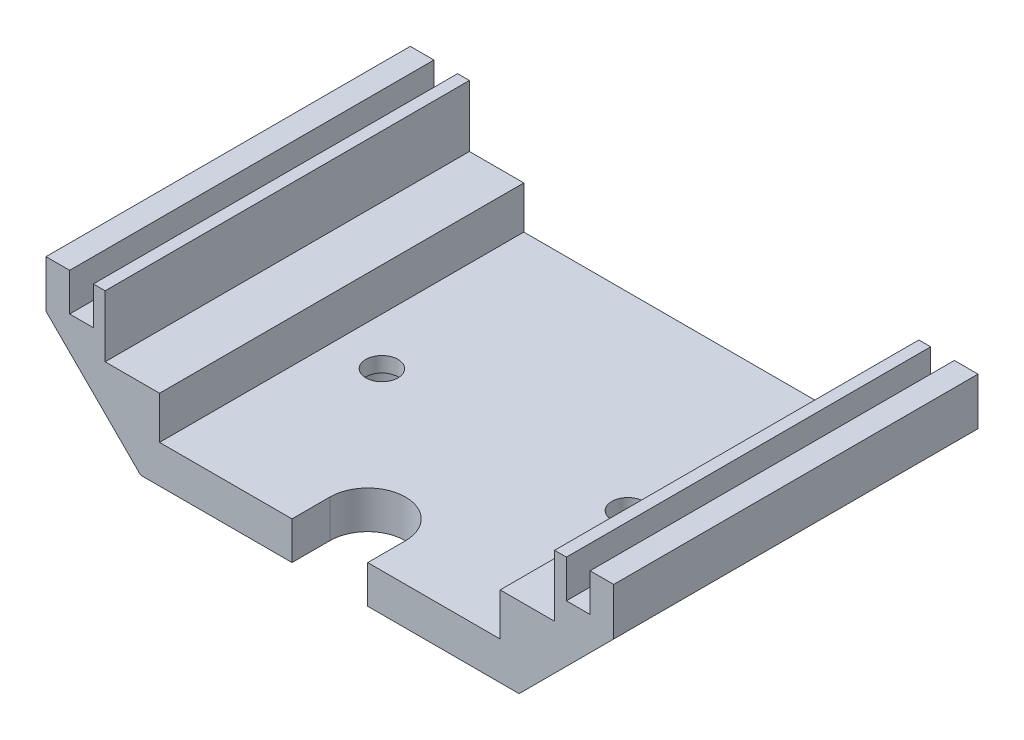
ISO-10303-21;
HEADER;
FILE_DESCRIPTION(('STEP AP214'),'2;1');
FILE_NAME('part.step','',(''),(''),'','','');
FILE_SCHEMA(('AUTOMOTIVE_DESIGN { 1 0 10303 214 1 1 1 1 }'));
ENDSEC;
DATA;
#1=APPLICATION_CONTEXT('core data for automotive mechanical design processes');
#2=APPLICATION_PROTOCOL_DEFINITION('international standard','automotive_design',2000,#1);
#3=PRODUCT_CONTEXT('',#1,'mechanical');
#4=PRODUCT('Part','Part','',(#3));
#5=PRODUCT_RELATED_PRODUCT_CATEGORY('part','',(#4));
#6=PRODUCT_DEFINITION_FORMATION('','',#4);
#7=PRODUCT_DEFINITION_CONTEXT('part definition',#1,'design');
#8=PRODUCT_DEFINITION('design','',#6,#7);
#9=PRODUCT_DEFINITION_SHAPE('','',#8);
#10=(LENGTH_UNIT() NAMED_UNIT(*) SI_UNIT(.MILLI.,.METRE.));
#11=(NAMED_UNIT(*) PLANE_ANGLE_UNIT() SI_UNIT($,.RADIAN.));
#12=(NAMED_UNIT(*) SI_UNIT($,.STERADIAN.) SOLID_ANGLE_UNIT());
#13=UNCERTAINTY_MEASURE_WITH_UNIT(LENGTH_MEASURE(1.E-05),#10,'distance_accuracy_value','');
#14=(GEOMETRIC_REPRESENTATION_CONTEXT(3) GLOBAL_UNCERTAINTY_ASSIGNED_CONTEXT((#13)) GLOBAL_UNIT_ASSIGNED_CONTEXT((#10,
#11,#12)) REPRESENTATION_CONTEXT('',''));
#15=CARTESIAN_POINT('',(0.,0.,0.));
#16=DIRECTION('',(0.,0.,1.));
#17=DIRECTION('',(1.,0.,0.));
#18=AXIS2_PLACEMENT_3D('',#15,#16,#17);
#19=CARTESIAN_POINT('',(-23.7500000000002,11.,3.33066907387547E-13));
#20=DIRECTION('',(0.,1.,0.));
#21=DIRECTION('',(0.,0.,1.));
#22=AXIS2_PLACEMENT_3D('',#19,#20,#21);
#23=PLANE('',#22);
#24=DIRECTION('',(0.,0.,1.));
#25=VECTOR('',#24,1.);
#26=CARTESIAN_POINT('',(-25.,11.,0.));
#27=LINE('',#26,#25);
#28=CARTESIAN_POINT('',(-25.,11.,38.5));
#29=VERTEX_POINT('',#28);
#30=CARTESIAN_POINT('',(-25.,11.,1.11022302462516E-13));
#31=VERTEX_POINT('',#30);
#32=EDGE_CURVE('E285',#29,#31,#27,.F.);
#33=ORIENTED_EDGE('',*,*,#32,.F.);
#34=DIRECTION('',(1.,0.,0.));
#35=VECTOR('',#34,1.);
#36=CARTESIAN_POINT('',(-23.7500000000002,11.,38.5));
#37=LINE('',#36,#35);
#38=CARTESIAN_POINT('',(-23.75,11.,38.5));
#39=VERTEX_POINT('',#38);
#40=EDGE_CURVE('E350',#29,#39,#37,.T.);
#41=ORIENTED_EDGE('',*,*,#40,.T.);
#42=DIRECTION('',(0.,0.,1.));
#43=VECTOR('',#42,1.);
#44=CARTESIAN_POINT('',(-23.7500000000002,11.,3.33066907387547E-13));
#45=LINE('',#44,#43);
#46=CARTESIAN_POINT('',(-23.7500000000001,11.,2.91433543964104E-13));
#47=VERTEX_POINT('',#46);
#48=EDGE_CURVE('E294',#47,#39,#45,.T.);
#49=ORIENTED_EDGE('',*,*,#48,.F.);
#50=DIRECTION('',(1.,0.,0.));
#51=VECTOR('',#50,1.);
#52=CARTESIAN_POINT('',(-23.7500000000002,11.,3.33066907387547E-13));
#53=LINE('',#52,#51);
#54=EDGE_CURVE('E357',#47,#31,#53,.F.);
#55=ORIENTED_EDGE('',*,*,#54,.T.);
#56=EDGE_LOOP('',(#33,#41,#49,#55));
#57=FACE_BOUND('',#56,.T.);
#58=ADVANCED_FACE('F16',(#57),#23,.T.);
#59=CARTESIAN_POINT('',(25.,11.,2.22044604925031E-13));
#60=DIRECTION('',(0.,1.,0.));
#61=DIRECTION('',(0.,0.,1.));
#62=AXIS2_PLACEMENT_3D('',#59,#60,#61);
#63=PLANE('',#62);
#64=DIRECTION('',(0.,0.,1.));
#65=VECTOR('',#64,1.);
#66=CARTESIAN_POINT('',(23.75,11.,3.33066907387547E-13));
#67=LINE('',#66,#65);
#68=CARTESIAN_POINT('',(23.75,11.,38.5));
#69=VERTEX_POINT('',#68);
#70=CARTESIAN_POINT('',(23.75,11.,1.94289029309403E-13));
#71=VERTEX_POINT('',#70);
#72=EDGE_CURVE('E192',#69,#71,#67,.F.);
#73=ORIENTED_EDGE('',*,*,#72,.F.);
#74=DIRECTION('',(1.,0.,0.));
#75=VECTOR('',#74,1.);
#76=CARTESIAN_POINT('',(25.,11.,38.5));
#77=LINE('',#76,#75);
#78=CARTESIAN_POINT('',(25.,11.,38.5000000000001));
#79=VERTEX_POINT('',#78);
#80=EDGE_CURVE('E344',#69,#79,#77,.T.);
#81=ORIENTED_EDGE('',*,*,#80,.T.);
#82=DIRECTION('',(0.,0.,1.));
#83=VECTOR('',#82,1.);
#84=CARTESIAN_POINT('',(25.,11.,2.22044604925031E-13));
#85=LINE('',#84,#83);
#86=CARTESIAN_POINT('',(25.,11.,1.66533453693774E-13));
#87=VERTEX_POINT('',#86);
#88=EDGE_CURVE('E195',#87,#79,#85,.T.);
#89=ORIENTED_EDGE('',*,*,#88,.F.);
#90=DIRECTION('',(1.,0.,0.));
#91=VECTOR('',#90,1.);
#92=CARTESIAN_POINT('',(25.,11.,2.22044604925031E-13));
#93=LINE('',#92,#91);
#94=EDGE_CURVE('E347',#87,#71,#93,.F.);
#95=ORIENTED_EDGE('',*,*,#94,.T.);
#96=EDGE_LOOP('',(#73,#81,#89,#95));
#97=FACE_BOUND('',#96,.T.);
#98=ADVANCED_FACE('F691',(#97),#63,.T.);
#99=CARTESIAN_POINT('',(-13.,-4.00000000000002,20.));
#100=DIRECTION('',(0.,1.,0.));
#101=DIRECTION('',(0.,0.,1.));
#102=AXIS2_PLACEMENT_3D('',#99,#100,#101);
#103=CYLINDRICAL_SURFACE('',#102,1.7);
#104=CARTESIAN_POINT('',(-13.,-1.6,20.));
#105=DIRECTION('',(0.,1.,0.));
#106=DIRECTION('',(0.,0.,1.));
#107=AXIS2_PLACEMENT_3D('',#104,#105,#106);
#108=CIRCLE('',#107,1.7);
#109=CARTESIAN_POINT('',(-13.,-1.6,21.7));
#110=VERTEX_POINT('',#109);
#111=EDGE_CURVE('E303',#110,#110,#108,.F.);
#112=ORIENTED_EDGE('',*,*,#111,.T.);
#113=EDGE_LOOP('',(#112));
#114=FACE_BOUND('',#113,.T.);
#115=CARTESIAN_POINT('',(-13.,0.,20.));
#116=DIRECTION('',(0.,1.,0.));
#117=DIRECTION('',(0.,0.,1.));
#118=AXIS2_PLACEMENT_3D('',#115,#116,#117);
#119=CIRCLE('',#118,1.7);
#120=CARTESIAN_POINT('',(-13.,0.,21.7));
#121=VERTEX_POINT('',#120);
#122=EDGE_CURVE('E188',#121,#121,#119,.F.);
#123=ORIENTED_EDGE('',*,*,#122,.F.);
#124=EDGE_LOOP('',(#123));
#125=FACE_BOUND('',#124,.T.);
#126=ADVANCED_FACE('F414',(#114,#125),#103,.F.);
#127=CARTESIAN_POINT('',(13.,-4.00000000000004,20.));
#128=DIRECTION('',(0.,1.,0.));
#129=DIRECTION('',(0.,0.,1.));
#130=AXIS2_PLACEMENT_3D('',#127,#128,#129);
#131=CYLINDRICAL_SURFACE('',#130,1.7);
#132=CARTESIAN_POINT('',(13.,-1.60000000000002,20.));
#133=DIRECTION('',(0.,1.,0.));
#134=DIRECTION('',(0.,0.,1.));
#135=AXIS2_PLACEMENT_3D('',#132,#133,#134);
#136=CIRCLE('',#135,1.7);
#137=CARTESIAN_POINT('',(13.,-1.60000000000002,21.7));
#138=VERTEX_POINT('',#137);
#139=EDGE_CURVE('E19',#138,#138,#136,.F.);
#140=ORIENTED_EDGE('',*,*,#139,.T.);
#141=EDGE_LOOP('',(#140));
#142=FACE_BOUND('',#141,.T.);
#143=CARTESIAN_POINT('',(13.,0.,20.));
#144=DIRECTION('',(0.,1.,0.));
#145=DIRECTION('',(0.,0.,1.));
#146=AXIS2_PLACEMENT_3D('',#143,#144,#145);
#147=CIRCLE('',#146,1.7);
#148=CARTESIAN_POINT('',(13.,0.,21.7));
#149=VERTEX_POINT('',#148);
#150=EDGE_CURVE('E220',#149,#149,#147,.F.);
#151=ORIENTED_EDGE('',*,*,#150,.F.);
#152=EDGE_LOOP('',(#151));
#153=FACE_BOUND('',#152,.T.);
#154=ADVANCED_FACE('F398',(#142,#153),#131,.F.);
#155=CARTESIAN_POINT('',(13.,-1.60000000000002,20.));
#156=DIRECTION('',(0.,1.,0.));
#157=DIRECTION('',(0.,0.,1.));
#158=AXIS2_PLACEMENT_3D('',#155,#156,#157);
#159=PLANE('',#158);
#160=CARTESIAN_POINT('',(13.,-1.60000000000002,20.));
#161=DIRECTION('',(0.,1.,0.));
#162=DIRECTION('',(0.,0.,1.));
#163=AXIS2_PLACEMENT_3D('',#160,#161,#162);
#164=CIRCLE('',#163,3.);
#165=CARTESIAN_POINT('',(13.,-1.60000000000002,23.));
#166=VERTEX_POINT('',#165);
#167=EDGE_CURVE('E183',#166,#166,#164,.F.);
#168=ORIENTED_EDGE('',*,*,#167,.T.);
#169=EDGE_LOOP('',(#168));
#170=FACE_BOUND('',#169,.T.);
#171=ORIENTED_EDGE('',*,*,#139,.F.);
#172=EDGE_LOOP('',(#171));
#173=FACE_BOUND('',#172,.T.);
#174=ADVANCED_FACE('F401',(#170,#173),#159,.F.);
#175=CARTESIAN_POINT('',(-13.,-1.6,20.));
#176=DIRECTION('',(0.,1.,0.));
#177=DIRECTION('',(0.,0.,1.));
#178=AXIS2_PLACEMENT_3D('',#175,#176,#177);
#179=PLANE('',#178);
#180=CARTESIAN_POINT('',(-13.,-1.6,20.));
#181=DIRECTION('',(0.,1.,0.));
#182=DIRECTION('',(0.,0.,1.));
#183=AXIS2_PLACEMENT_3D('',#180,#181,#182);
#184=CIRCLE('',#183,3.);
#185=CARTESIAN_POINT('',(-13.,-1.6,23.));
#186=VERTEX_POINT('',#185);
#187=EDGE_CURVE('E159',#186,#186,#184,.F.);
#188=ORIENTED_EDGE('',*,*,#187,.T.);
#189=EDGE_LOOP('',(#188));
#190=FACE_BOUND('',#189,.T.);
#191=ORIENTED_EDGE('',*,*,#111,.F.);
#192=EDGE_LOOP('',(#191));
#193=FACE_BOUND('',#192,.T.);
#194=ADVANCED_FACE('F403',(#190,#193),#179,.F.);
#195=CARTESIAN_POINT('',(-18.0000000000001,0.,3.33066907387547E-13));
#196=DIRECTION('',(1.,0.,0.));
#197=DIRECTION('',(0.,1.,0.));
#198=AXIS2_PLACEMENT_3D('',#195,#196,#197);
#199=PLANE('',#198);
#200=DIRECTION('',(0.,0.,1.));
#201=VECTOR('',#200,1.);
#202=CARTESIAN_POINT('',(-18.0000000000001,4.5,3.33066907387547E-13));
#203=LINE('',#202,#201);
#204=CARTESIAN_POINT('',(-18.0000000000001,4.5,38.5000000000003));
#205=VERTEX_POINT('',#204);
#206=CARTESIAN_POINT('',(-18.0000000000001,4.5,2.4980018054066E-13));
#207=VERTEX_POINT('',#206);
#208=EDGE_CURVE('E300',#205,#207,#203,.F.);
#209=ORIENTED_EDGE('',*,*,#208,.F.);
#210=DIRECTION('',(0.,-1.,0.));
#211=VECTOR('',#210,1.);
#212=CARTESIAN_POINT('',(-18.0000000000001,0.,38.5000000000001));
#213=LINE('',#212,#211);
#214=CARTESIAN_POINT('',(-18.0000000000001,0.,38.5000000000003));
#215=VERTEX_POINT('',#214);
#216=EDGE_CURVE('E332',#215,#205,#213,.F.);
#217=ORIENTED_EDGE('',*,*,#216,.F.);
#218=DIRECTION('',(0.,0.,1.));
#219=VECTOR('',#218,1.);
#220=CARTESIAN_POINT('',(-18.0000000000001,0.,0.));
#221=LINE('',#220,#219);
#222=CARTESIAN_POINT('',(-18.0000000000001,0.,0.));
#223=VERTEX_POINT('',#222);
#224=EDGE_CURVE('E181',#223,#215,#221,.T.);
#225=ORIENTED_EDGE('',*,*,#224,.F.);
#226=DIRECTION('',(0.,-1.,0.));
#227=VECTOR('',#226,1.);
#228=CARTESIAN_POINT('',(-18.0000000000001,0.,0.));
#229=LINE('',#228,#227);
#230=EDGE_CURVE('E341',#223,#207,#229,.F.);
#231=ORIENTED_EDGE('',*,*,#230,.T.);
#232=EDGE_LOOP('',(#209,#217,#225,#231));
#233=FACE_BOUND('',#232,.T.);
#234=ADVANCED_FACE('F411',(#233),#199,.T.);
#235=CARTESIAN_POINT('',(-18.0000000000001,4.5,3.33066907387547E-13));
#236=DIRECTION('',(0.,1.,0.));
#237=DIRECTION('',(0.,0.,1.));
#238=AXIS2_PLACEMENT_3D('',#235,#236,#237);
#239=PLANE('',#238);
#240=DIRECTION('',(0.,0.,1.));
#241=VECTOR('',#240,1.);
#242=CARTESIAN_POINT('',(-23.7500000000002,4.5,3.33066907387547E-13));
#243=LINE('',#242,#241);
#244=CARTESIAN_POINT('',(-23.7500000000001,4.5,38.5000000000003));
#245=VERTEX_POINT('',#244);
#246=CARTESIAN_POINT('',(-23.7500000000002,4.5,2.4980018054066E-13));
#247=VERTEX_POINT('',#246);
#248=EDGE_CURVE('E297',#245,#247,#243,.F.);
#249=ORIENTED_EDGE('',*,*,#248,.F.);
#250=DIRECTION('',(1.,0.,0.));
#251=VECTOR('',#250,1.);
#252=CARTESIAN_POINT('',(0.,4.5,38.5000000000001));
#253=LINE('',#252,#251);
#254=EDGE_CURVE('E369',#205,#245,#253,.F.);
#255=ORIENTED_EDGE('',*,*,#254,.F.);
#256=ORIENTED_EDGE('',*,*,#208,.T.);
#257=DIRECTION('',(1.,0.,0.));
#258=VECTOR('',#257,1.);
#259=CARTESIAN_POINT('',(0.,4.5,0.));
#260=LINE('',#259,#258);
#261=EDGE_CURVE('E374',#207,#247,#260,.F.);
#262=ORIENTED_EDGE('',*,*,#261,.T.);
#263=EDGE_LOOP('',(#249,#255,#256,#262));
#264=FACE_BOUND('',#263,.T.);
#265=ADVANCED_FACE('F517',(#264),#239,.T.);
#266=CARTESIAN_POINT('',(-23.7500000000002,4.5,3.33066907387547E-13));
#267=DIRECTION('',(1.,0.,0.));
#268=DIRECTION('',(0.,1.,0.));
#269=AXIS2_PLACEMENT_3D('',#266,#267,#268);
#270=PLANE('',#269);
#271=ORIENTED_EDGE('',*,*,#48,.T.);
#272=DIRECTION('',(0.,-1.,0.));
#273=VECTOR('',#272,1.);
#274=CARTESIAN_POINT('',(-23.75,0.,38.5000000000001));
#275=LINE('',#274,#273);
#276=EDGE_CURVE('E326',#245,#39,#275,.F.);
#277=ORIENTED_EDGE('',*,*,#276,.F.);
#278=ORIENTED_EDGE('',*,*,#248,.T.);
#279=DIRECTION('',(0.,-1.,0.));
#280=VECTOR('',#279,1.);
#281=CARTESIAN_POINT('',(-23.7500000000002,0.,0.));
#282=LINE('',#281,#280);
#283=EDGE_CURVE('E289',#247,#47,#282,.F.);
#284=ORIENTED_EDGE('',*,*,#283,.T.);
#285=EDGE_LOOP('',(#271,#277,#278,#284));
#286=FACE_BOUND('',#285,.T.);
#287=ADVANCED_FACE('F513',(#286),#270,.T.);
#288=CARTESIAN_POINT('',(-25.,11.,0.));
#289=DIRECTION('',(-1.,0.,0.));
#290=DIRECTION('',(0.,-1.,0.));
#291=AXIS2_PLACEMENT_3D('',#288,#289,#290);
#292=PLANE('',#291);
#293=DIRECTION('',(0.,0.,1.));
#294=VECTOR('',#293,1.);
#295=CARTESIAN_POINT('',(-25.,7.,0.));
#296=LINE('',#295,#294);
#297=CARTESIAN_POINT('',(-25.,7.,38.5000000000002));
#298=VERTEX_POINT('',#297);
#299=CARTESIAN_POINT('',(-25.,7.,0.));
#300=VERTEX_POINT('',#299);
#301=EDGE_CURVE('E276',#298,#300,#296,.F.);
#302=ORIENTED_EDGE('',*,*,#301,.F.);
#303=DIRECTION('',(0.,-1.,0.));
#304=VECTOR('',#303,1.);
#305=CARTESIAN_POINT('',(-25.,0.,38.5000000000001));
#306=LINE('',#305,#304);
#307=EDGE_CURVE('E321',#29,#298,#306,.T.);
#308=ORIENTED_EDGE('',*,*,#307,.F.);
#309=ORIENTED_EDGE('',*,*,#32,.T.);
#310=DIRECTION('',(0.,-1.,0.));
#311=VECTOR('',#310,1.);
#312=CARTESIAN_POINT('',(-25.,0.,0.));
#313=LINE('',#312,#311);
#314=EDGE_CURVE('E280',#31,#300,#313,.T.);
#315=ORIENTED_EDGE('',*,*,#314,.T.);
#316=EDGE_LOOP('',(#302,#308,#309,#315));
#317=FACE_BOUND('',#316,.T.);
#318=ADVANCED_FACE('F509',(#317),#292,.T.);
#319=CARTESIAN_POINT('',(-25.,7.,0.));
#320=DIRECTION('',(0.,1.,0.));
#321=DIRECTION('',(0.,0.,1.));
#322=AXIS2_PLACEMENT_3D('',#319,#320,#321);
#323=PLANE('',#322);
#324=DIRECTION('',(0.,0.,1.));
#325=VECTOR('',#324,1.);
#326=CARTESIAN_POINT('',(-27.5000000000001,7.00000000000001,3.33066907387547E-13));
#327=LINE('',#326,#325);
#328=CARTESIAN_POINT('',(-27.5000000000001,7.,38.5000000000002));
#329=VERTEX_POINT('',#328);
#330=CARTESIAN_POINT('',(-27.5000000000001,7.,0.));
#331=VERTEX_POINT('',#330);
#332=EDGE_CURVE('E267',#329,#331,#327,.F.);
#333=ORIENTED_EDGE('',*,*,#332,.F.);
#334=DIRECTION('',(1.,0.,0.));
#335=VECTOR('',#334,1.);
#336=CARTESIAN_POINT('',(0.,7.00000000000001,38.5000000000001));
#337=LINE('',#336,#335);
#338=EDGE_CURVE('E316',#298,#329,#337,.F.);
#339=ORIENTED_EDGE('',*,*,#338,.F.);
#340=ORIENTED_EDGE('',*,*,#301,.T.);
#341=DIRECTION('',(1.,0.,0.));
#342=VECTOR('',#341,1.);
#343=CARTESIAN_POINT('',(0.,7.,0.));
#344=LINE('',#343,#342);
#345=EDGE_CURVE('E271',#300,#331,#344,.F.);
#346=ORIENTED_EDGE('',*,*,#345,.T.);
#347=EDGE_LOOP('',(#333,#339,#340,#346));
#348=FACE_BOUND('',#347,.T.);
#349=ADVANCED_FACE('F505',(#348),#323,.T.);
#350=CARTESIAN_POINT('',(-27.5000000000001,7.,3.33066907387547E-13));
#351=DIRECTION('',(1.,0.,0.));
#352=DIRECTION('',(0.,1.,0.));
#353=AXIS2_PLACEMENT_3D('',#350,#351,#352);
#354=PLANE('',#353);
#355=DIRECTION('',(0.,0.,1.));
#356=VECTOR('',#355,1.);
#357=CARTESIAN_POINT('',(-27.5000000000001,11.,3.33066907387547E-13));
#358=LINE('',#357,#356);
#359=CARTESIAN_POINT('',(-27.5000000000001,11.,38.5000000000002));
#360=VERTEX_POINT('',#359);
#361=CARTESIAN_POINT('',(-27.5000000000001,11.,0.));
#362=VERTEX_POINT('',#361);
#363=EDGE_CURVE('E258',#360,#362,#358,.F.);
#364=ORIENTED_EDGE('',*,*,#363,.F.);
#365=DIRECTION('',(0.,-1.,0.));
#366=VECTOR('',#365,1.);
#367=CARTESIAN_POINT('',(-27.5000000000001,0.,38.5000000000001));
#368=LINE('',#367,#366);
#369=EDGE_CURVE('E311',#329,#360,#368,.F.);
#370=ORIENTED_EDGE('',*,*,#369,.F.);
#371=ORIENTED_EDGE('',*,*,#332,.T.);
#372=DIRECTION('',(0.,-1.,0.));
#373=VECTOR('',#372,1.);
#374=CARTESIAN_POINT('',(-27.5000000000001,0.,0.));
#375=LINE('',#374,#373);
#376=EDGE_CURVE('E262',#331,#362,#375,.F.);
#377=ORIENTED_EDGE('',*,*,#376,.T.);
#378=EDGE_LOOP('',(#364,#370,#371,#377));
#379=FACE_BOUND('',#378,.T.);
#380=ADVANCED_FACE('F501',(#379),#354,.T.);
#381=CARTESIAN_POINT('',(-27.5000000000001,11.,3.33066907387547E-13));
#382=DIRECTION('',(0.,1.,0.));
#383=DIRECTION('',(0.,0.,1.));
#384=AXIS2_PLACEMENT_3D('',#381,#382,#383);
#385=PLANE('',#384);
#386=DIRECTION('',(0.,0.,1.));
#387=VECTOR('',#386,1.);
#388=CARTESIAN_POINT('',(-30.0000000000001,11.,2.22044604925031E-13));
#389=LINE('',#388,#387);
#390=CARTESIAN_POINT('',(-30.0000000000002,11.,38.5000000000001));
#391=VERTEX_POINT('',#390);
#392=CARTESIAN_POINT('',(-30.0000000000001,11.,0.));
#393=VERTEX_POINT('',#392);
#394=EDGE_CURVE('E236',#391,#393,#389,.F.);
#395=ORIENTED_EDGE('',*,*,#394,.F.);
#396=DIRECTION('',(1.,0.,0.));
#397=VECTOR('',#396,1.);
#398=CARTESIAN_POINT('',(0.,11.,38.5000000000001));
#399=LINE('',#398,#397);
#400=EDGE_CURVE('E306',#360,#391,#399,.F.);
#401=ORIENTED_EDGE('',*,*,#400,.F.);
#402=ORIENTED_EDGE('',*,*,#363,.T.);
#403=DIRECTION('',(1.,0.,0.));
#404=VECTOR('',#403,1.);
#405=CARTESIAN_POINT('',(0.,11.,0.));
#406=LINE('',#405,#404);
#407=EDGE_CURVE('E253',#362,#393,#406,.F.);
#408=ORIENTED_EDGE('',*,*,#407,.T.);
#409=EDGE_LOOP('',(#395,#401,#402,#408));
#410=FACE_BOUND('',#409,.T.);
#411=ADVANCED_FACE('F497',(#410),#385,.T.);
#412=CARTESIAN_POINT('',(-30.0000000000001,11.,2.22044604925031E-13));
#413=DIRECTION('',(-1.,0.,0.));
#414=DIRECTION('',(0.,-1.,0.));
#415=AXIS2_PLACEMENT_3D('',#412,#413,#414);
#416=PLANE('',#415);
#417=DIRECTION('',(0.,0.,1.));
#418=VECTOR('',#417,1.);
#419=CARTESIAN_POINT('',(-30.0000000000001,5.99999999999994,2.22044604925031E-13));
#420=LINE('',#419,#418);
#421=CARTESIAN_POINT('',(-30.0000000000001,5.99999999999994,38.5000000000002));
#422=VERTEX_POINT('',#421);
#423=CARTESIAN_POINT('',(-30.0000000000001,5.99999999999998,0.));
#424=VERTEX_POINT('',#423);
#425=EDGE_CURVE('E244',#422,#424,#420,.F.);
#426=ORIENTED_EDGE('',*,*,#425,.F.);
#427=DIRECTION('',(0.,-1.,0.));
#428=VECTOR('',#427,1.);
#429=CARTESIAN_POINT('',(-30.0000000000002,0.,38.5000000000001));
#430=LINE('',#429,#428);
#431=EDGE_CURVE('E248',#391,#422,#430,.T.);
#432=ORIENTED_EDGE('',*,*,#431,.F.);
#433=ORIENTED_EDGE('',*,*,#394,.T.);
#434=DIRECTION('',(0.,-1.,0.));
#435=VECTOR('',#434,1.);
#436=CARTESIAN_POINT('',(-30.0000000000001,0.,0.));
#437=LINE('',#436,#435);
#438=EDGE_CURVE('E251',#393,#424,#437,.T.);
#439=ORIENTED_EDGE('',*,*,#438,.T.);
#440=EDGE_LOOP('',(#426,#432,#433,#439));
#441=FACE_BOUND('',#440,.T.);
#442=ADVANCED_FACE('F493',(#441),#416,.T.);
#443=CARTESIAN_POINT('',(30.,6.00000000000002,3.33066907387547E-13));
#444=DIRECTION('',(1.,0.,0.));
#445=DIRECTION('',(0.,1.,0.));
#446=AXIS2_PLACEMENT_3D('',#443,#444,#445);
#447=PLANE('',#446);
#448=DIRECTION('',(0.,0.,1.));
#449=VECTOR('',#448,1.);
#450=CARTESIAN_POINT('',(29.9999999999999,11.,3.33066907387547E-13));
#451=LINE('',#450,#449);
#452=CARTESIAN_POINT('',(29.9999999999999,11.,38.5000000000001));
#453=VERTEX_POINT('',#452);
#454=CARTESIAN_POINT('',(30.,11.,0.));
#455=VERTEX_POINT('',#454);
#456=EDGE_CURVE('E207',#453,#455,#451,.F.);
#457=ORIENTED_EDGE('',*,*,#456,.F.);
#458=DIRECTION('',(0.,-1.,0.));
#459=VECTOR('',#458,1.);
#460=CARTESIAN_POINT('',(29.9999999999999,0.,38.5000000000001));
#461=LINE('',#460,#459);
#462=CARTESIAN_POINT('',(29.9999999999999,6.,38.5000000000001));
#463=VERTEX_POINT('',#462);
#464=EDGE_CURVE('E212',#463,#453,#461,.F.);
#465=ORIENTED_EDGE('',*,*,#464,.F.);
#466=DIRECTION('',(0.,0.,1.));
#467=VECTOR('',#466,1.);
#468=CARTESIAN_POINT('',(30.,6.,3.33066907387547E-13));
#469=LINE('',#468,#467);
#470=CARTESIAN_POINT('',(30.,6.00000000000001,2.22044604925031E-13));
#471=VERTEX_POINT('',#470);
#472=EDGE_CURVE('E178',#471,#463,#469,.T.);
#473=ORIENTED_EDGE('',*,*,#472,.F.);
#474=DIRECTION('',(0.,-1.,0.));
#475=VECTOR('',#474,1.);
#476=CARTESIAN_POINT('',(30.,0.,0.));
#477=LINE('',#476,#475);
#478=EDGE_CURVE('E228',#471,#455,#477,.F.);
#479=ORIENTED_EDGE('',*,*,#478,.T.);
#480=EDGE_LOOP('',(#457,#465,#473,#479));
#481=FACE_BOUND('',#480,.T.);
#482=ADVANCED_FACE('F489',(#481),#447,.T.);
#483=CARTESIAN_POINT('',(30.,11.,3.33066907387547E-13));
#484=DIRECTION('',(0.,1.,0.));
#485=DIRECTION('',(0.,0.,1.));
#486=AXIS2_PLACEMENT_3D('',#483,#484,#485);
#487=PLANE('',#486);
#488=DIRECTION('',(0.,0.,1.));
#489=VECTOR('',#488,1.);
#490=CARTESIAN_POINT('',(27.5,11.,3.33066907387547E-13));
#491=LINE('',#490,#489);
#492=CARTESIAN_POINT('',(27.5,11.,38.5));
#493=VERTEX_POINT('',#492);
#494=CARTESIAN_POINT('',(27.5,11.,2.4980018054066E-13));
#495=VERTEX_POINT('',#494);
#496=EDGE_CURVE('E204',#493,#495,#491,.F.);
#497=ORIENTED_EDGE('',*,*,#496,.F.);
#498=DIRECTION('',(1.,0.,0.));
#499=VECTOR('',#498,1.);
#500=CARTESIAN_POINT('',(0.,11.,38.5000000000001));
#501=LINE('',#500,#499);
#502=EDGE_CURVE('E215',#453,#493,#501,.F.);
#503=ORIENTED_EDGE('',*,*,#502,.F.);
#504=ORIENTED_EDGE('',*,*,#456,.T.);
#505=DIRECTION('',(1.,0.,0.));
#506=VECTOR('',#505,1.);
#507=CARTESIAN_POINT('',(0.,11.,0.));
#508=LINE('',#507,#506);
#509=EDGE_CURVE('E230',#455,#495,#508,.F.);
#510=ORIENTED_EDGE('',*,*,#509,.T.);
#511=EDGE_LOOP('',(#497,#503,#504,#510));
#512=FACE_BOUND('',#511,.T.);
#513=ADVANCED_FACE('F485',(#512),#487,.T.);
#514=CARTESIAN_POINT('',(27.5,11.,3.33066907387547E-13));
#515=DIRECTION('',(-1.,0.,0.));
#516=DIRECTION('',(0.,-1.,0.));
#517=AXIS2_PLACEMENT_3D('',#514,#515,#516);
#518=PLANE('',#517);
#519=DIRECTION('',(0.,0.,1.));
#520=VECTOR('',#519,1.);
#521=CARTESIAN_POINT('',(27.5,7.00000000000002,3.33066907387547E-13));
#522=LINE('',#521,#520);
#523=CARTESIAN_POINT('',(27.5,7.00000000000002,38.5000000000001));
#524=VERTEX_POINT('',#523);
#525=CARTESIAN_POINT('',(27.5,7.00000000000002,2.4980018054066E-13));
#526=VERTEX_POINT('',#525);
#527=EDGE_CURVE('E201',#524,#526,#522,.F.);
#528=ORIENTED_EDGE('',*,*,#527,.F.);
#529=DIRECTION('',(0.,-1.,0.));
#530=VECTOR('',#529,1.);
#531=CARTESIAN_POINT('',(27.5,0.,38.5000000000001));
#532=LINE('',#531,#530);
#533=EDGE_CURVE('E353',#493,#524,#532,.T.);
#534=ORIENTED_EDGE('',*,*,#533,.F.);
#535=ORIENTED_EDGE('',*,*,#496,.T.);
#536=DIRECTION('',(0.,-1.,0.));
#537=VECTOR('',#536,1.);
#538=CARTESIAN_POINT('',(27.5,0.,0.));
#539=LINE('',#538,#537);
#540=EDGE_CURVE('E241',#495,#526,#539,.T.);
#541=ORIENTED_EDGE('',*,*,#540,.T.);
#542=EDGE_LOOP('',(#528,#534,#535,#541));
#543=FACE_BOUND('',#542,.T.);
#544=ADVANCED_FACE('F481',(#543),#518,.T.);
#545=CARTESIAN_POINT('',(27.5,7.00000000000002,3.33066907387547E-13));
#546=DIRECTION('',(0.,1.,0.));
#547=DIRECTION('',(0.,0.,1.));
#548=AXIS2_PLACEMENT_3D('',#545,#546,#547);
#549=PLANE('',#548);
#550=DIRECTION('',(0.,0.,1.));
#551=VECTOR('',#550,1.);
#552=CARTESIAN_POINT('',(25.,7.,2.22044604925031E-13));
#553=LINE('',#552,#551);
#554=CARTESIAN_POINT('',(25.,7.00000000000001,38.5000000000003));
#555=VERTEX_POINT('',#554);
#556=CARTESIAN_POINT('',(25.,7.00000000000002,2.22044604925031E-13));
#557=VERTEX_POINT('',#556);
#558=EDGE_CURVE('E198',#555,#557,#553,.F.);
#559=ORIENTED_EDGE('',*,*,#558,.F.);
#560=DIRECTION('',(1.,0.,0.));
#561=VECTOR('',#560,1.);
#562=CARTESIAN_POINT('',(0.,7.,38.5000000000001));
#563=LINE('',#562,#561);
#564=EDGE_CURVE('E596',#524,#555,#563,.F.);
#565=ORIENTED_EDGE('',*,*,#564,.F.);
#566=ORIENTED_EDGE('',*,*,#527,.T.);
#567=DIRECTION('',(1.,0.,0.));
#568=VECTOR('',#567,1.);
#569=CARTESIAN_POINT('',(0.,7.00000000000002,0.));
#570=LINE('',#569,#568);
#571=EDGE_CURVE('E565',#526,#557,#570,.F.);
#572=ORIENTED_EDGE('',*,*,#571,.T.);
#573=EDGE_LOOP('',(#559,#565,#566,#572));
#574=FACE_BOUND('',#573,.T.);
#575=ADVANCED_FACE('F477',(#574),#549,.T.);
#576=CARTESIAN_POINT('',(25.,7.00000000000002,2.22044604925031E-13));
#577=DIRECTION('',(1.,0.,0.));
#578=DIRECTION('',(0.,1.,0.));
#579=AXIS2_PLACEMENT_3D('',#576,#577,#578);
#580=PLANE('',#579);
#581=ORIENTED_EDGE('',*,*,#88,.T.);
#582=DIRECTION('',(0.,-1.,0.));
#583=VECTOR('',#582,1.);
#584=CARTESIAN_POINT('',(25.,0.,38.5000000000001));
#585=LINE('',#584,#583);
#586=EDGE_CURVE('E599',#555,#79,#585,.F.);
#587=ORIENTED_EDGE('',*,*,#586,.F.);
#588=ORIENTED_EDGE('',*,*,#558,.T.);
#589=DIRECTION('',(0.,-1.,0.));
#590=VECTOR('',#589,1.);
#591=CARTESIAN_POINT('',(25.,0.,0.));
#592=LINE('',#591,#590);
#593=EDGE_CURVE('E568',#557,#87,#592,.F.);
#594=ORIENTED_EDGE('',*,*,#593,.T.);
#595=EDGE_LOOP('',(#581,#587,#588,#594));
#596=FACE_BOUND('',#595,.T.);
#597=ADVANCED_FACE('F473',(#596),#580,.T.);
#598=CARTESIAN_POINT('',(23.75,11.,3.33066907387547E-13));
#599=DIRECTION('',(-1.,0.,0.));
#600=DIRECTION('',(0.,-1.,0.));
#601=AXIS2_PLACEMENT_3D('',#598,#599,#600);
#602=PLANE('',#601);
#603=DIRECTION('',(0.,0.,1.));
#604=VECTOR('',#603,1.);
#605=CARTESIAN_POINT('',(23.7499999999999,4.5,3.33066907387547E-13));
#606=LINE('',#605,#604);
#607=CARTESIAN_POINT('',(23.75,4.5,38.5));
#608=VERTEX_POINT('',#607);
#609=CARTESIAN_POINT('',(23.75,4.5,2.4980018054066E-13));
#610=VERTEX_POINT('',#609);
#611=EDGE_CURVE('E189',#608,#610,#606,.F.);
#612=ORIENTED_EDGE('',*,*,#611,.F.);
#613=DIRECTION('',(0.,-1.,0.));
#614=VECTOR('',#613,1.);
#615=CARTESIAN_POINT('',(23.7499999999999,0.,38.5000000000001));
#616=LINE('',#615,#614);
#617=EDGE_CURVE('E602',#69,#608,#616,.T.);
#618=ORIENTED_EDGE('',*,*,#617,.F.);
#619=ORIENTED_EDGE('',*,*,#72,.T.);
#620=DIRECTION('',(0.,-1.,0.));
#621=VECTOR('',#620,1.);
#622=CARTESIAN_POINT('',(23.75,0.,0.));
#623=LINE('',#622,#621);
#624=EDGE_CURVE('E571',#71,#610,#623,.T.);
#625=ORIENTED_EDGE('',*,*,#624,.T.);
#626=EDGE_LOOP('',(#612,#618,#619,#625));
#627=FACE_BOUND('',#626,.T.);
#628=ADVANCED_FACE('F469',(#627),#602,.T.);
#629=CARTESIAN_POINT('',(23.75,4.5,3.33066907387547E-13));
#630=DIRECTION('',(0.,1.,0.));
#631=DIRECTION('',(0.,0.,1.));
#632=AXIS2_PLACEMENT_3D('',#629,#630,#631);
#633=PLANE('',#632);
#634=DIRECTION('',(0.,0.,1.));
#635=VECTOR('',#634,1.);
#636=CARTESIAN_POINT('',(18.,4.5,0.));
#637=LINE('',#636,#635);
#638=CARTESIAN_POINT('',(18.,4.5,38.5000000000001));
#639=VERTEX_POINT('',#638);
#640=CARTESIAN_POINT('',(18.,4.5,0.));
#641=VERTEX_POINT('',#640);
#642=EDGE_CURVE('E185',#639,#641,#637,.F.);
#643=ORIENTED_EDGE('',*,*,#642,.F.);
#644=DIRECTION('',(1.,0.,0.));
#645=VECTOR('',#644,1.);
#646=CARTESIAN_POINT('',(0.,4.5,38.5000000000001));
#647=LINE('',#646,#645);
#648=EDGE_CURVE('E225',#608,#639,#647,.F.);
#649=ORIENTED_EDGE('',*,*,#648,.F.);
#650=ORIENTED_EDGE('',*,*,#611,.T.);
#651=DIRECTION('',(1.,0.,0.));
#652=VECTOR('',#651,1.);
#653=CARTESIAN_POINT('',(0.,4.5,0.));
#654=LINE('',#653,#652);
#655=EDGE_CURVE('E574',#610,#641,#654,.F.);
#656=ORIENTED_EDGE('',*,*,#655,.T.);
#657=EDGE_LOOP('',(#643,#649,#650,#656));
#658=FACE_BOUND('',#657,.T.);
#659=ADVANCED_FACE('F465',(#658),#633,.T.);
#660=CARTESIAN_POINT('',(18.,4.5,0.));
#661=DIRECTION('',(-1.,0.,0.));
#662=DIRECTION('',(0.,-1.,0.));
#663=AXIS2_PLACEMENT_3D('',#660,#661,#662);
#664=PLANE('',#663);
#665=DIRECTION('',(0.,0.,1.));
#666=VECTOR('',#665,1.);
#667=CARTESIAN_POINT('',(18.,0.,0.));
#668=LINE('',#667,#666);
#669=CARTESIAN_POINT('',(18.,0.,38.5000000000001));
#670=VERTEX_POINT('',#669);
#671=CARTESIAN_POINT('',(18.,0.,0.));
#672=VERTEX_POINT('',#671);
#673=EDGE_CURVE('E184',#670,#672,#668,.F.);
#674=ORIENTED_EDGE('',*,*,#673,.F.);
#675=DIRECTION('',(0.,-1.,0.));
#676=VECTOR('',#675,1.);
#677=CARTESIAN_POINT('',(18.,0.,38.5000000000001));
#678=LINE('',#677,#676);
#679=EDGE_CURVE('E172',#639,#670,#678,.T.);
#680=ORIENTED_EDGE('',*,*,#679,.F.);
#681=ORIENTED_EDGE('',*,*,#642,.T.);
#682=DIRECTION('',(0.,-1.,0.));
#683=VECTOR('',#682,1.);
#684=CARTESIAN_POINT('',(18.,0.,0.));
#685=LINE('',#684,#683);
#686=EDGE_CURVE('E335',#641,#672,#685,.T.);
#687=ORIENTED_EDGE('',*,*,#686,.T.);
#688=EDGE_LOOP('',(#674,#680,#681,#687));
#689=FACE_BOUND('',#688,.T.);
#690=ADVANCED_FACE('F462',(#689),#664,.T.);
#691=CARTESIAN_POINT('',(18.,0.,0.));
#692=DIRECTION('',(0.,1.,0.));
#693=DIRECTION('',(0.,0.,1.));
#694=AXIS2_PLACEMENT_3D('',#691,#692,#693);
#695=PLANE('',#694);
#696=DIRECTION('',(1.,0.,0.));
#697=VECTOR('',#696,1.);
#698=CARTESIAN_POINT('',(0.,0.,0.));
#699=LINE('',#698,#697);
#700=EDGE_CURVE('E337',#672,#223,#699,.F.);
#701=ORIENTED_EDGE('',*,*,#700,.T.);
#702=ORIENTED_EDGE('',*,*,#224,.T.);
#703=DIRECTION('',(1.,0.,0.));
#704=VECTOR('',#703,1.);
#705=CARTESIAN_POINT('',(0.,0.,38.5000000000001));
#706=LINE('',#705,#704);
#707=CARTESIAN_POINT('',(-4.00000000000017,0.,38.5000000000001));
#708=VERTEX_POINT('',#707);
#709=EDGE_CURVE('E146',#708,#215,#706,.F.);
#710=ORIENTED_EDGE('',*,*,#709,.F.);
#711=DIRECTION('',(0.,0.,1.));
#712=VECTOR('',#711,1.);
#713=CARTESIAN_POINT('',(-4.00000000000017,0.,38.5000000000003));
#714=LINE('',#713,#712);
#715=CARTESIAN_POINT('',(-4.00000000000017,0.,34.5000000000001));
#716=VERTEX_POINT('',#715);
#717=EDGE_CURVE('E137',#708,#716,#714,.F.);
#718=ORIENTED_EDGE('',*,*,#717,.T.);
#719=CARTESIAN_POINT('',(0.,0.,34.5000000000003));
#720=DIRECTION('',(0.,-1.,0.));
#721=DIRECTION('',(0.,0.,-1.));
#722=AXIS2_PLACEMENT_3D('',#719,#720,#721);
#723=CIRCLE('',#722,4.);
#724=CARTESIAN_POINT('',(4.,0.,34.5000000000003));
#725=VERTEX_POINT('',#724);
#726=EDGE_CURVE('E142',#716,#725,#723,.T.);
#727=ORIENTED_EDGE('',*,*,#726,.T.);
#728=DIRECTION('',(0.,0.,1.));
#729=VECTOR('',#728,1.);
#730=CARTESIAN_POINT('',(4.,0.,34.5000000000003));
#731=LINE('',#730,#729);
#732=CARTESIAN_POINT('',(4.,0.,38.5000000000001));
#733=VERTEX_POINT('',#732);
#734=EDGE_CURVE('E170',#725,#733,#731,.T.);
#735=ORIENTED_EDGE('',*,*,#734,.T.);
#736=DIRECTION('',(1.,0.,0.));
#737=VECTOR('',#736,1.);
#738=CARTESIAN_POINT('',(0.,0.,38.5000000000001));
#739=LINE('',#738,#737);
#740=EDGE_CURVE('E175',#670,#733,#739,.F.);
#741=ORIENTED_EDGE('',*,*,#740,.F.);
#742=ORIENTED_EDGE('',*,*,#673,.T.);
#743=EDGE_LOOP('',(#701,#702,#710,#718,#727,#735,#741,#742));
#744=FACE_BOUND('',#743,.T.);
#745=ORIENTED_EDGE('',*,*,#150,.T.);
#746=EDGE_LOOP('',(#745));
#747=FACE_BOUND('',#746,.T.);
#748=ORIENTED_EDGE('',*,*,#122,.T.);
#749=EDGE_LOOP('',(#748));
#750=FACE_BOUND('',#749,.T.);
#751=ADVANCED_FACE('F140',(#744,#747,#750),#695,.T.);
#752=CARTESIAN_POINT('',(13.,-4.00000000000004,20.));
#753=DIRECTION('',(0.,1.,0.));
#754=DIRECTION('',(0.,0.,1.));
#755=AXIS2_PLACEMENT_3D('',#752,#753,#754);
#756=CYLINDRICAL_SURFACE('',#755,3.);
#757=ORIENTED_EDGE('',*,*,#167,.F.);
#758=EDGE_LOOP('',(#757));
#759=FACE_BOUND('',#758,.T.);
#760=CARTESIAN_POINT('',(13.,-4.00000000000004,20.));
#761=DIRECTION('',(0.,1.,0.));
#762=DIRECTION('',(0.,0.,1.));
#763=AXIS2_PLACEMENT_3D('',#760,#761,#762);
#764=CIRCLE('',#763,3.);
#765=CARTESIAN_POINT('',(13.,-4.00000000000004,23.));
#766=VERTEX_POINT('',#765);
#767=EDGE_CURVE('E382',#766,#766,#764,.T.);
#768=ORIENTED_EDGE('',*,*,#767,.F.);
#769=EDGE_LOOP('',(#768));
#770=FACE_BOUND('',#769,.T.);
#771=ADVANCED_FACE('F455',(#759,#770),#756,.F.);
#772=CARTESIAN_POINT('',(-13.,-4.00000000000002,20.));
#773=DIRECTION('',(0.,1.,0.));
#774=DIRECTION('',(0.,0.,1.));
#775=AXIS2_PLACEMENT_3D('',#772,#773,#774);
#776=CYLINDRICAL_SURFACE('',#775,3.);
#777=ORIENTED_EDGE('',*,*,#187,.F.);
#778=EDGE_LOOP('',(#777));
#779=FACE_BOUND('',#778,.T.);
#780=CARTESIAN_POINT('',(-13.,-4.00000000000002,20.));
#781=DIRECTION('',(0.,1.,0.));
#782=DIRECTION('',(0.,0.,1.));
#783=AXIS2_PLACEMENT_3D('',#780,#781,#782);
#784=CIRCLE('',#783,3.);
#785=CARTESIAN_POINT('',(-13.,-4.00000000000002,23.));
#786=VERTEX_POINT('',#785);
#787=EDGE_CURVE('E379',#786,#786,#784,.T.);
#788=ORIENTED_EDGE('',*,*,#787,.F.);
#789=EDGE_LOOP('',(#788));
#790=FACE_BOUND('',#789,.T.);
#791=ADVANCED_FACE('F452',(#779,#790),#776,.F.);
#792=CARTESIAN_POINT('',(0.,-4.00000000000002,34.5000000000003));
#793=DIRECTION('',(0.,-1.,0.));
#794=DIRECTION('',(0.,0.,-1.));
#795=AXIS2_PLACEMENT_3D('',#792,#793,#794);
#796=CYLINDRICAL_SURFACE('',#795,4.);
#797=ORIENTED_EDGE('',*,*,#726,.F.);
#798=DIRECTION('',(0.,-1.,0.));
#799=VECTOR('',#798,1.);
#800=CARTESIAN_POINT('',(-4.00000000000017,-4.00000000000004,34.5));
#801=LINE('',#800,#799);
#802=CARTESIAN_POINT('',(-4.00000000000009,-4.00000000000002,34.5000000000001));
#803=VERTEX_POINT('',#802);
#804=EDGE_CURVE('E150',#716,#803,#801,.T.);
#805=ORIENTED_EDGE('',*,*,#804,.T.);
#806=CARTESIAN_POINT('',(0.,-4.00000000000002,34.5000000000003));
#807=DIRECTION('',(0.,-1.,0.));
#808=DIRECTION('',(0.,0.,-1.));
#809=AXIS2_PLACEMENT_3D('',#806,#807,#808);
#810=CIRCLE('',#809,4.);
#811=CARTESIAN_POINT('',(4.,-4.00000000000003,34.5000000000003));
#812=VERTEX_POINT('',#811);
#813=EDGE_CURVE('E377',#812,#803,#810,.F.);
#814=ORIENTED_EDGE('',*,*,#813,.F.);
#815=DIRECTION('',(0.,1.,0.));
#816=VECTOR('',#815,1.);
#817=CARTESIAN_POINT('',(4.,-4.00000000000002,34.5000000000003));
#818=LINE('',#817,#816);
#819=EDGE_CURVE('E157',#812,#725,#818,.T.);
#820=ORIENTED_EDGE('',*,*,#819,.T.);
#821=EDGE_LOOP('',(#797,#805,#814,#820));
#822=FACE_BOUND('',#821,.T.);
#823=ADVANCED_FACE('F154',(#822),#796,.F.);
#824=CARTESIAN_POINT('',(-4.00000000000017,-4.00000000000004,38.5000000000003));
#825=DIRECTION('',(-1.,0.,0.));
#826=DIRECTION('',(0.,-1.,0.));
#827=AXIS2_PLACEMENT_3D('',#824,#825,#826);
#828=PLANE('',#827);
#829=ORIENTED_EDGE('',*,*,#717,.F.);
#830=DIRECTION('',(0.,-1.,0.));
#831=VECTOR('',#830,1.);
#832=CARTESIAN_POINT('',(-4.00000000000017,0.,38.5000000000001));
#833=LINE('',#832,#831);
#834=CARTESIAN_POINT('',(-4.00000000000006,-4.00000000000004,38.5000000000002));
#835=VERTEX_POINT('',#834);
#836=EDGE_CURVE('E164',#835,#708,#833,.F.);
#837=ORIENTED_EDGE('',*,*,#836,.F.);
#838=DIRECTION('',(0.,0.,-1.));
#839=VECTOR('',#838,1.);
#840=CARTESIAN_POINT('',(-4.,-4.00000000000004,3.33066907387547E-13));
#841=LINE('',#840,#839);
#842=EDGE_CURVE('E163',#803,#835,#841,.F.);
#843=ORIENTED_EDGE('',*,*,#842,.F.);
#844=ORIENTED_EDGE('',*,*,#804,.F.);
#845=EDGE_LOOP('',(#829,#837,#843,#844));
#846=FACE_BOUND('',#845,.T.);
#847=ADVANCED_FACE('F161',(#846),#828,.F.);
#848=CARTESIAN_POINT('',(0.,0.,38.5000000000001));
#849=DIRECTION('',(0.,0.,1.));
#850=DIRECTION('',(0.,-1.,0.));
#851=AXIS2_PLACEMENT_3D('',#848,#849,#850);
#852=PLANE('',#851);
#853=ORIENTED_EDGE('',*,*,#431,.T.);
#854=DIRECTION('',(0.707106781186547,-0.707106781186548,0.));
#855=VECTOR('',#854,1.);
#856=CARTESIAN_POINT('',(-30.0000000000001,6.,38.5000000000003));
#857=LINE('',#856,#855);
#858=CARTESIAN_POINT('',(-20.,-4.00000000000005,38.5000000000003));
#859=VERTEX_POINT('',#858);
#860=EDGE_CURVE('E247',#859,#422,#857,.F.);
#861=ORIENTED_EDGE('',*,*,#860,.F.);
#862=DIRECTION('',(1.,0.,0.));
#863=VECTOR('',#862,1.);
#864=CARTESIAN_POINT('',(-20.,-4.00000000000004,38.5000000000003));
#865=LINE('',#864,#863);
#866=EDGE_CURVE('E545',#835,#859,#865,.F.);
#867=ORIENTED_EDGE('',*,*,#866,.F.);
#868=ORIENTED_EDGE('',*,*,#836,.T.);
#869=ORIENTED_EDGE('',*,*,#709,.T.);
#870=ORIENTED_EDGE('',*,*,#216,.T.);
#871=ORIENTED_EDGE('',*,*,#254,.T.);
#872=ORIENTED_EDGE('',*,*,#276,.T.);
#873=ORIENTED_EDGE('',*,*,#40,.F.);
#874=ORIENTED_EDGE('',*,*,#307,.T.);
#875=ORIENTED_EDGE('',*,*,#338,.T.);
#876=ORIENTED_EDGE('',*,*,#369,.T.);
#877=ORIENTED_EDGE('',*,*,#400,.T.);
#878=EDGE_LOOP('',(#853,#861,#867,#868,#869,#870,#871,#872,#873,#874,#875,#876,#877));
#879=FACE_BOUND('',#878,.T.);
#880=ADVANCED_FACE('F443',(#879),#852,.T.);
#881=CARTESIAN_POINT('',(-30.0000000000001,6.,2.22044604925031E-13));
#882=DIRECTION('',(-0.707106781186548,-0.707106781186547,0.));
#883=DIRECTION('',(0.707106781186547,-0.707106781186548,0.));
#884=AXIS2_PLACEMENT_3D('',#881,#882,#883);
#885=PLANE('',#884);
#886=DIRECTION('',(0.,0.,-1.));
#887=VECTOR('',#886,1.);
#888=CARTESIAN_POINT('',(-20.,-4.00000000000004,3.33066907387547E-13));
#889=LINE('',#888,#887);
#890=CARTESIAN_POINT('',(-20.,-4.00000000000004,2.22044604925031E-13));
#891=VERTEX_POINT('',#890);
#892=EDGE_CURVE('E548',#859,#891,#889,.T.);
#893=ORIENTED_EDGE('',*,*,#892,.F.);
#894=ORIENTED_EDGE('',*,*,#860,.T.);
#895=ORIENTED_EDGE('',*,*,#425,.T.);
#896=DIRECTION('',(0.70710678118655,-0.707106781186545,0.));
#897=VECTOR('',#896,1.);
#898=CARTESIAN_POINT('',(-30.0000000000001,6.,0.));
#899=LINE('',#898,#897);
#900=EDGE_CURVE('E231',#424,#891,#899,.T.);
#901=ORIENTED_EDGE('',*,*,#900,.T.);
#902=EDGE_LOOP('',(#893,#894,#895,#901));
#903=FACE_BOUND('',#902,.T.);
#904=ADVANCED_FACE('F439',(#903),#885,.T.);
#905=CARTESIAN_POINT('',(0.,0.,0.));
#906=DIRECTION('',(0.,0.,1.));
#907=DIRECTION('',(0.,-1.,0.));
#908=AXIS2_PLACEMENT_3D('',#905,#906,#907);
#909=PLANE('',#908);
#910=ORIENTED_EDGE('',*,*,#624,.F.);
#911=ORIENTED_EDGE('',*,*,#94,.F.);
#912=ORIENTED_EDGE('',*,*,#593,.F.);
#913=ORIENTED_EDGE('',*,*,#571,.F.);
#914=ORIENTED_EDGE('',*,*,#540,.F.);
#915=ORIENTED_EDGE('',*,*,#509,.F.);
#916=ORIENTED_EDGE('',*,*,#478,.F.);
#917=DIRECTION('',(0.707106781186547,0.707106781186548,0.));
#918=VECTOR('',#917,1.);
#919=CARTESIAN_POINT('',(20.,-4.00000000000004,3.33066907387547E-13));
#920=LINE('',#919,#918);
#921=CARTESIAN_POINT('',(20.,-4.00000000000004,3.33066907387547E-13));
#922=VERTEX_POINT('',#921);
#923=EDGE_CURVE('E209',#922,#471,#920,.T.);
#924=ORIENTED_EDGE('',*,*,#923,.F.);
#925=DIRECTION('',(1.,0.,0.));
#926=VECTOR('',#925,1.);
#927=CARTESIAN_POINT('',(-20.,-4.00000000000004,3.33066907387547E-13));
#928=LINE('',#927,#926);
#929=EDGE_CURVE('E557',#891,#922,#928,.T.);
#930=ORIENTED_EDGE('',*,*,#929,.F.);
#931=ORIENTED_EDGE('',*,*,#900,.F.);
#932=ORIENTED_EDGE('',*,*,#438,.F.);
#933=ORIENTED_EDGE('',*,*,#407,.F.);
#934=ORIENTED_EDGE('',*,*,#376,.F.);
#935=ORIENTED_EDGE('',*,*,#345,.F.);
#936=ORIENTED_EDGE('',*,*,#314,.F.);
#937=ORIENTED_EDGE('',*,*,#54,.F.);
#938=ORIENTED_EDGE('',*,*,#283,.F.);
#939=ORIENTED_EDGE('',*,*,#261,.F.);
#940=ORIENTED_EDGE('',*,*,#230,.F.);
#941=ORIENTED_EDGE('',*,*,#700,.F.);
#942=ORIENTED_EDGE('',*,*,#686,.F.);
#943=ORIENTED_EDGE('',*,*,#655,.F.);
#944=EDGE_LOOP('',(#910,#911,#912,#913,#914,#915,#916,#924,#930,#931,#932,#933,#934,#935,#936,
#937,#938,#939,#940,#941,#942,#943));
#945=FACE_BOUND('',#944,.T.);
#946=ADVANCED_FACE('F435',(#945),#909,.F.);
#947=CARTESIAN_POINT('',(20.,-4.00000000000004,3.33066907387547E-13));
#948=DIRECTION('',(0.707106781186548,-0.707106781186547,0.));
#949=DIRECTION('',(0.707106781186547,0.707106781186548,0.));
#950=AXIS2_PLACEMENT_3D('',#947,#948,#949);
#951=PLANE('',#950);
#952=ORIENTED_EDGE('',*,*,#472,.T.);
#953=DIRECTION('',(0.707106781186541,0.707106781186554,0.));
#954=VECTOR('',#953,1.);
#955=CARTESIAN_POINT('',(20.,-4.00000000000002,38.5000000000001));
#956=LINE('',#955,#954);
#957=CARTESIAN_POINT('',(20.,-4.00000000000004,38.5));
#958=VERTEX_POINT('',#957);
#959=EDGE_CURVE('E177',#958,#463,#956,.T.);
#960=ORIENTED_EDGE('',*,*,#959,.F.);
#961=DIRECTION('',(0.,0.,-1.));
#962=VECTOR('',#961,1.);
#963=CARTESIAN_POINT('',(20.,-4.00000000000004,3.33066907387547E-13));
#964=LINE('',#963,#962);
#965=EDGE_CURVE('E581',#922,#958,#964,.F.);
#966=ORIENTED_EDGE('',*,*,#965,.F.);
#967=ORIENTED_EDGE('',*,*,#923,.T.);
#968=EDGE_LOOP('',(#952,#960,#966,#967));
#969=FACE_BOUND('',#968,.T.);
#970=ADVANCED_FACE('F432',(#969),#951,.T.);
#971=CARTESIAN_POINT('',(0.,0.,38.5000000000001));
#972=DIRECTION('',(0.,0.,1.));
#973=DIRECTION('',(0.,-1.,0.));
#974=AXIS2_PLACEMENT_3D('',#971,#972,#973);
#975=PLANE('',#974);
#976=ORIENTED_EDGE('',*,*,#648,.T.);
#977=ORIENTED_EDGE('',*,*,#679,.T.);
#978=ORIENTED_EDGE('',*,*,#740,.T.);
#979=DIRECTION('',(0.,1.,0.));
#980=VECTOR('',#979,1.);
#981=CARTESIAN_POINT('',(4.,-4.00000000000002,38.5000000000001));
#982=LINE('',#981,#980);
#983=CARTESIAN_POINT('',(4.,-4.00000000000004,38.5));
#984=VERTEX_POINT('',#983);
#985=EDGE_CURVE('E34',#733,#984,#982,.F.);
#986=ORIENTED_EDGE('',*,*,#985,.T.);
#987=DIRECTION('',(1.,0.,0.));
#988=VECTOR('',#987,1.);
#989=CARTESIAN_POINT('',(-20.,-4.00000000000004,38.5));
#990=LINE('',#989,#988);
#991=EDGE_CURVE('E25',#958,#984,#990,.F.);
#992=ORIENTED_EDGE('',*,*,#991,.F.);
#993=ORIENTED_EDGE('',*,*,#959,.T.);
#994=ORIENTED_EDGE('',*,*,#464,.T.);
#995=ORIENTED_EDGE('',*,*,#502,.T.);
#996=ORIENTED_EDGE('',*,*,#533,.T.);
#997=ORIENTED_EDGE('',*,*,#564,.T.);
#998=ORIENTED_EDGE('',*,*,#586,.T.);
#999=ORIENTED_EDGE('',*,*,#80,.F.);
#1000=ORIENTED_EDGE('',*,*,#617,.T.);
#1001=EDGE_LOOP('',(#976,#977,#978,#986,#992,#993,#994,#995,#996,#997,#998,#999,#1000));
#1002=FACE_BOUND('',#1001,.T.);
#1003=ADVANCED_FACE('F424',(#1002),#975,.T.);
#1004=CARTESIAN_POINT('',(4.,-4.00000000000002,34.5000000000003));
#1005=DIRECTION('',(1.,0.,0.));
#1006=DIRECTION('',(0.,1.,0.));
#1007=AXIS2_PLACEMENT_3D('',#1004,#1005,#1006);
#1008=PLANE('',#1007);
#1009=DIRECTION('',(0.,0.,-1.));
#1010=VECTOR('',#1009,1.);
#1011=CARTESIAN_POINT('',(4.,-4.00000000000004,3.33066907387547E-13));
#1012=LINE('',#1011,#1010);
#1013=EDGE_CURVE('E11',#984,#812,#1012,.T.);
#1014=ORIENTED_EDGE('',*,*,#1013,.F.);
#1015=ORIENTED_EDGE('',*,*,#985,.F.);
#1016=ORIENTED_EDGE('',*,*,#734,.F.);
#1017=ORIENTED_EDGE('',*,*,#819,.F.);
#1018=EDGE_LOOP('',(#1014,#1015,#1016,#1017));
#1019=FACE_BOUND('',#1018,.T.);
#1020=ADVANCED_FACE('F418',(#1019),#1008,.F.);
#1021=CARTESIAN_POINT('',(-20.,-4.00000000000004,3.33066907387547E-13));
#1022=DIRECTION('',(0.,-1.,0.));
#1023=DIRECTION('',(0.,0.,-1.));
#1024=AXIS2_PLACEMENT_3D('',#1021,#1022,#1023);
#1025=PLANE('',#1024);
#1026=ORIENTED_EDGE('',*,*,#991,.T.);
#1027=ORIENTED_EDGE('',*,*,#1013,.T.);
#1028=ORIENTED_EDGE('',*,*,#813,.T.);
#1029=ORIENTED_EDGE('',*,*,#842,.T.);
#1030=ORIENTED_EDGE('',*,*,#866,.T.);
#1031=ORIENTED_EDGE('',*,*,#892,.T.);
#1032=ORIENTED_EDGE('',*,*,#929,.T.);
#1033=ORIENTED_EDGE('',*,*,#965,.T.);
#1034=EDGE_LOOP('',(#1026,#1027,#1028,#1029,#1030,#1031,#1032,#1033));
#1035=FACE_BOUND('',#1034,.T.);
#1036=ORIENTED_EDGE('',*,*,#787,.T.);
#1037=EDGE_LOOP('',(#1036));
#1038=FACE_BOUND('',#1037,.T.);
#1039=ORIENTED_EDGE('',*,*,#767,.T.);
#1040=EDGE_LOOP('',(#1039));
#1041=FACE_BOUND('',#1040,.T.);
#1042=ADVANCED_FACE('F416',(#1035,#1038,#1041),#1025,.T.);
#1043=CLOSED_SHELL('',(#58,#98,#126,#154,#174,#194,#234,#265,#287,#318,#349,#380,#411,#442,#482,
#513,#544,#575,#597,#628,#659,#690,#751,#771,#791,#823,#847,#880,#904,#946,#970,#1003,#1020,#1042));
#1044=MANIFOLD_SOLID_BREP('B1',#1043);
#1045=ADVANCED_BREP_SHAPE_REPRESENTATION('',(#18,#1044),#14);
#1046=SHAPE_DEFINITION_REPRESENTATION(#9,#1045);
ENDSEC;
END-ISO-10303-21;
